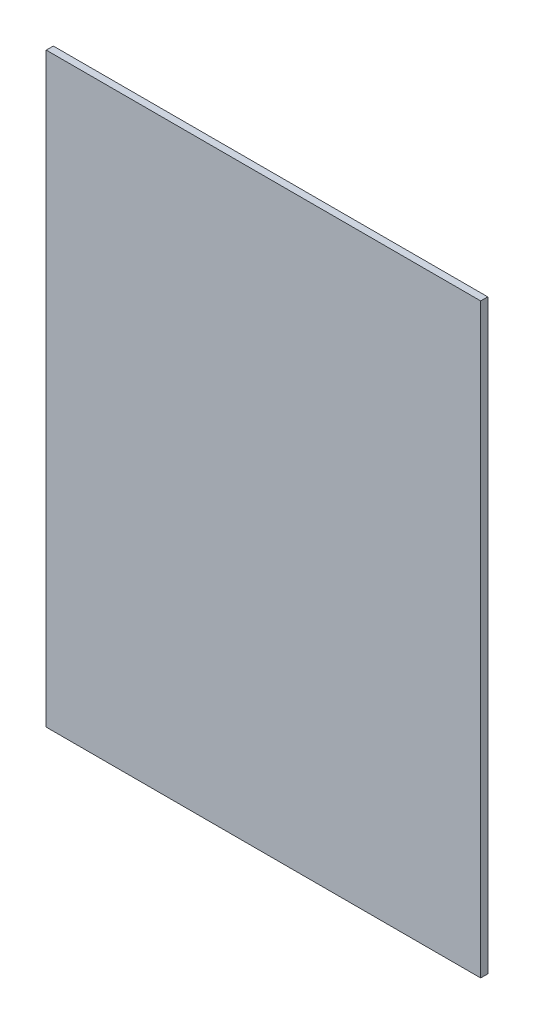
from build123d import *

# Parameters (mm, degrees)
ESQUISSE1_W      = 615
ESQUISSE1_H      = 830
EXTRUSION1_DEPTH = 10


with BuildPart() as part:
    # Esquisse1 → Extrusion1 (new body)
    with BuildSketch(Plane.XY):
        with Locations((307.5, 415)):
            Rectangle(ESQUISSE1_W, ESQUISSE1_H)
    extrude(amount=EXTRUSION1_DEPTH)


solid = part.part
